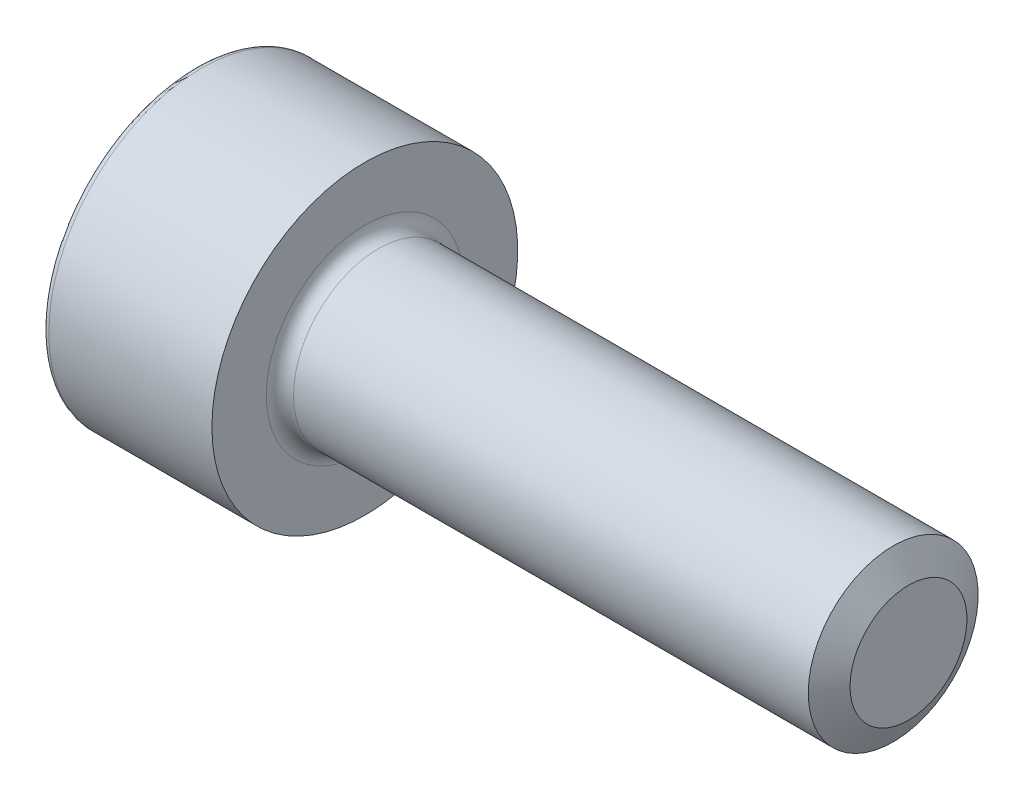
ISO-10303-21;
HEADER;
FILE_DESCRIPTION(('STEP AP214'),'2;1');
FILE_NAME('part.step','',(''),(''),'','','');
FILE_SCHEMA(('AUTOMOTIVE_DESIGN { 1 0 10303 214 1 1 1 1 }'));
ENDSEC;
DATA;
#1=APPLICATION_CONTEXT('core data for automotive mechanical design processes');
#2=APPLICATION_PROTOCOL_DEFINITION('international standard','automotive_design',2000,#1);
#3=PRODUCT_CONTEXT('',#1,'mechanical');
#4=PRODUCT('Part','Part','',(#3));
#5=PRODUCT_RELATED_PRODUCT_CATEGORY('part','',(#4));
#6=PRODUCT_DEFINITION_FORMATION('','',#4);
#7=PRODUCT_DEFINITION_CONTEXT('part definition',#1,'design');
#8=PRODUCT_DEFINITION('design','',#6,#7);
#9=PRODUCT_DEFINITION_SHAPE('','',#8);
#10=(LENGTH_UNIT() NAMED_UNIT(*) SI_UNIT(.MILLI.,.METRE.));
#11=(NAMED_UNIT(*) PLANE_ANGLE_UNIT() SI_UNIT($,.RADIAN.));
#12=(NAMED_UNIT(*) SI_UNIT($,.STERADIAN.) SOLID_ANGLE_UNIT());
#13=UNCERTAINTY_MEASURE_WITH_UNIT(LENGTH_MEASURE(1.E-05),#10,'distance_accuracy_value','');
#14=(GEOMETRIC_REPRESENTATION_CONTEXT(3) GLOBAL_UNCERTAINTY_ASSIGNED_CONTEXT((#13)) GLOBAL_UNIT_ASSIGNED_CONTEXT((#10,
#11,#12)) REPRESENTATION_CONTEXT('',''));
#15=CARTESIAN_POINT('',(0.,0.,0.));
#16=DIRECTION('',(0.,0.,1.));
#17=DIRECTION('',(1.,0.,0.));
#18=AXIS2_PLACEMENT_3D('',#15,#16,#17);
#19=CARTESIAN_POINT('',(10.5,1.25,0.));
#20=DIRECTION('',(-1.,0.,0.));
#21=DIRECTION('',(0.,0.,1.));
#22=AXIS2_PLACEMENT_3D('',#19,#20,#21);
#23=PLANE('',#22);
#24=CARTESIAN_POINT('',(10.5,0.,0.));
#25=DIRECTION('',(-1.,0.,0.));
#26=DIRECTION('',(0.,0.,1.));
#27=AXIS2_PLACEMENT_3D('',#24,#25,#26);
#28=CIRCLE('',#27,0.8603);
#29=CARTESIAN_POINT('',(10.5,0.,0.8603));
#30=VERTEX_POINT('',#29);
#31=EDGE_CURVE('E131',#30,#30,#28,.T.);
#32=ORIENTED_EDGE('',*,*,#31,.F.);
#33=EDGE_LOOP('',(#32));
#34=FACE_BOUND('',#33,.T.);
#35=ADVANCED_FACE('F17',(#34),#23,.F.);
#36=CARTESIAN_POINT('',(1.1,-0.995929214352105,0.575));
#37=DIRECTION('',(1.,0.,0.));
#38=DIRECTION('',(0.,1.,0.));
#39=AXIS2_PLACEMENT_3D('',#36,#37,#38);
#40=PLANE('',#39);
#41=DIRECTION('',(0.,0.866025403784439,0.5));
#42=VECTOR('',#41,1.);
#43=CARTESIAN_POINT('',(1.1,-0.995929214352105,0.575));
#44=LINE('',#43,#42);
#45=CARTESIAN_POINT('',(1.1,-0.995929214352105,0.575));
#46=VERTEX_POINT('',#45);
#47=CARTESIAN_POINT('',(1.1,0.,1.15));
#48=VERTEX_POINT('',#47);
#49=EDGE_CURVE('E118',#46,#48,#44,.T.);
#50=ORIENTED_EDGE('',*,*,#49,.T.);
#51=DIRECTION('',(0.,0.866025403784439,-0.5));
#52=VECTOR('',#51,1.);
#53=CARTESIAN_POINT('',(1.1,0.,1.15));
#54=LINE('',#53,#52);
#55=CARTESIAN_POINT('',(1.1,0.995929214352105,0.575));
#56=VERTEX_POINT('',#55);
#57=EDGE_CURVE('E11',#48,#56,#54,.T.);
#58=ORIENTED_EDGE('',*,*,#57,.T.);
#59=DIRECTION('',(0.,0.,-1.));
#60=VECTOR('',#59,1.);
#61=CARTESIAN_POINT('',(1.1,0.995929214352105,0.575));
#62=LINE('',#61,#60);
#63=CARTESIAN_POINT('',(1.1,0.995929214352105,-0.575));
#64=VERTEX_POINT('',#63);
#65=EDGE_CURVE('E44',#56,#64,#62,.T.);
#66=ORIENTED_EDGE('',*,*,#65,.T.);
#67=DIRECTION('',(0.,-0.866025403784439,-0.5));
#68=VECTOR('',#67,1.);
#69=CARTESIAN_POINT('',(1.1,0.995929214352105,-0.575));
#70=LINE('',#69,#68);
#71=CARTESIAN_POINT('',(1.1,0.,-1.15));
#72=VERTEX_POINT('',#71);
#73=EDGE_CURVE('E93',#64,#72,#70,.T.);
#74=ORIENTED_EDGE('',*,*,#73,.T.);
#75=DIRECTION('',(0.,-0.866025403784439,0.5));
#76=VECTOR('',#75,1.);
#77=CARTESIAN_POINT('',(1.1,0.,-1.15));
#78=LINE('',#77,#76);
#79=CARTESIAN_POINT('',(1.1,-0.995929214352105,-0.575));
#80=VERTEX_POINT('',#79);
#81=EDGE_CURVE('E86',#72,#80,#78,.T.);
#82=ORIENTED_EDGE('',*,*,#81,.T.);
#83=DIRECTION('',(0.,0.,1.));
#84=VECTOR('',#83,1.);
#85=CARTESIAN_POINT('',(1.1,-0.995929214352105,-0.575));
#86=LINE('',#85,#84);
#87=EDGE_CURVE('E90',#80,#46,#86,.T.);
#88=ORIENTED_EDGE('',*,*,#87,.T.);
#89=EDGE_LOOP('',(#50,#58,#66,#74,#82,#88));
#90=FACE_BOUND('',#89,.T.);
#91=ADVANCED_FACE('F88',(#90),#40,.F.);
#92=CARTESIAN_POINT('',(1.1,0.,1.15));
#93=DIRECTION('',(0.,0.5,0.866025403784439));
#94=DIRECTION('',(1.,0.,0.));
#95=AXIS2_PLACEMENT_3D('',#92,#93,#94);
#96=PLANE('',#95);
#97=DIRECTION('',(0.,0.866025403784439,-0.5));
#98=VECTOR('',#97,1.);
#99=CARTESIAN_POINT('',(0.,0.,1.15));
#100=LINE('',#99,#98);
#101=CARTESIAN_POINT('',(0.,0.,1.15));
#102=VERTEX_POINT('',#101);
#103=CARTESIAN_POINT('',(0.,0.995929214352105,0.575));
#104=VERTEX_POINT('',#103);
#105=EDGE_CURVE('E141',#102,#104,#100,.T.);
#106=ORIENTED_EDGE('',*,*,#105,.T.);
#107=DIRECTION('',(-1.,0.,0.));
#108=VECTOR('',#107,1.);
#109=CARTESIAN_POINT('',(1.1,0.995929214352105,0.575));
#110=LINE('',#109,#108);
#111=EDGE_CURVE('E25',#56,#104,#110,.T.);
#112=ORIENTED_EDGE('',*,*,#111,.F.);
#113=ORIENTED_EDGE('',*,*,#57,.F.);
#114=DIRECTION('',(-1.,0.,0.));
#115=VECTOR('',#114,1.);
#116=CARTESIAN_POINT('',(1.1,0.,1.15));
#117=LINE('',#116,#115);
#118=EDGE_CURVE('E137',#48,#102,#117,.T.);
#119=ORIENTED_EDGE('',*,*,#118,.T.);
#120=EDGE_LOOP('',(#106,#112,#113,#119));
#121=FACE_BOUND('',#120,.T.);
#122=ADVANCED_FACE('F196',(#121),#96,.F.);
#123=CARTESIAN_POINT('',(1.1,0.995929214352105,0.575));
#124=DIRECTION('',(0.,1.,0.));
#125=DIRECTION('',(0.,0.,-1.));
#126=AXIS2_PLACEMENT_3D('',#123,#124,#125);
#127=PLANE('',#126);
#128=DIRECTION('',(0.,0.,-1.));
#129=VECTOR('',#128,1.);
#130=CARTESIAN_POINT('',(0.,0.995929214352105,0.575));
#131=LINE('',#130,#129);
#132=CARTESIAN_POINT('',(0.,0.995929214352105,-0.575));
#133=VERTEX_POINT('',#132);
#134=EDGE_CURVE('E174',#104,#133,#131,.T.);
#135=ORIENTED_EDGE('',*,*,#134,.T.);
#136=DIRECTION('',(-1.,0.,0.));
#137=VECTOR('',#136,1.);
#138=CARTESIAN_POINT('',(1.1,0.995929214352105,-0.575));
#139=LINE('',#138,#137);
#140=EDGE_CURVE('E132',#64,#133,#139,.T.);
#141=ORIENTED_EDGE('',*,*,#140,.F.);
#142=ORIENTED_EDGE('',*,*,#65,.F.);
#143=ORIENTED_EDGE('',*,*,#111,.T.);
#144=EDGE_LOOP('',(#135,#141,#142,#143));
#145=FACE_BOUND('',#144,.T.);
#146=ADVANCED_FACE('F188',(#145),#127,.F.);
#147=CARTESIAN_POINT('',(1.1,0.995929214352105,-0.575));
#148=DIRECTION('',(0.,0.5,-0.866025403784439));
#149=DIRECTION('',(-1.,0.,0.));
#150=AXIS2_PLACEMENT_3D('',#147,#148,#149);
#151=PLANE('',#150);
#152=DIRECTION('',(0.,-0.866025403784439,-0.5));
#153=VECTOR('',#152,1.);
#154=CARTESIAN_POINT('',(0.,0.995929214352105,-0.575));
#155=LINE('',#154,#153);
#156=CARTESIAN_POINT('',(0.,0.,-1.15));
#157=VERTEX_POINT('',#156);
#158=EDGE_CURVE('E170',#133,#157,#155,.T.);
#159=ORIENTED_EDGE('',*,*,#158,.T.);
#160=DIRECTION('',(-1.,0.,0.));
#161=VECTOR('',#160,1.);
#162=CARTESIAN_POINT('',(1.1,0.,-1.15));
#163=LINE('',#162,#161);
#164=EDGE_CURVE('E97',#72,#157,#163,.T.);
#165=ORIENTED_EDGE('',*,*,#164,.F.);
#166=ORIENTED_EDGE('',*,*,#73,.F.);
#167=ORIENTED_EDGE('',*,*,#140,.T.);
#168=EDGE_LOOP('',(#159,#165,#166,#167));
#169=FACE_BOUND('',#168,.T.);
#170=ADVANCED_FACE('F246',(#169),#151,.F.);
#171=CARTESIAN_POINT('',(1.1,0.,-1.15));
#172=DIRECTION('',(0.,-0.5,-0.866025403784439));
#173=DIRECTION('',(0.,-0.866025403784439,0.5));
#174=AXIS2_PLACEMENT_3D('',#171,#172,#173);
#175=PLANE('',#174);
#176=DIRECTION('',(0.,-0.866025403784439,0.5));
#177=VECTOR('',#176,1.);
#178=CARTESIAN_POINT('',(0.,0.,-1.15));
#179=LINE('',#178,#177);
#180=CARTESIAN_POINT('',(0.,-0.995929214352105,-0.575));
#181=VERTEX_POINT('',#180);
#182=EDGE_CURVE('E103',#157,#181,#179,.T.);
#183=ORIENTED_EDGE('',*,*,#182,.T.);
#184=DIRECTION('',(-1.,0.,0.));
#185=VECTOR('',#184,1.);
#186=CARTESIAN_POINT('',(1.1,-0.995929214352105,-0.575));
#187=LINE('',#186,#185);
#188=EDGE_CURVE('E98',#80,#181,#187,.T.);
#189=ORIENTED_EDGE('',*,*,#188,.F.);
#190=ORIENTED_EDGE('',*,*,#81,.F.);
#191=ORIENTED_EDGE('',*,*,#164,.T.);
#192=EDGE_LOOP('',(#183,#189,#190,#191));
#193=FACE_BOUND('',#192,.T.);
#194=ADVANCED_FACE('F101',(#193),#175,.F.);
#195=CARTESIAN_POINT('',(1.1,-0.995929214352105,-0.575));
#196=DIRECTION('',(0.,-1.,0.));
#197=DIRECTION('',(0.,0.,-1.));
#198=AXIS2_PLACEMENT_3D('',#195,#196,#197);
#199=PLANE('',#198);
#200=DIRECTION('',(0.,0.,1.));
#201=VECTOR('',#200,1.);
#202=CARTESIAN_POINT('',(0.,-0.995929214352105,-0.575));
#203=LINE('',#202,#201);
#204=CARTESIAN_POINT('',(0.,-0.995929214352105,0.575));
#205=VERTEX_POINT('',#204);
#206=EDGE_CURVE('E165',#181,#205,#203,.T.);
#207=ORIENTED_EDGE('',*,*,#206,.T.);
#208=DIRECTION('',(-1.,0.,0.));
#209=VECTOR('',#208,1.);
#210=CARTESIAN_POINT('',(1.1,-0.995929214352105,0.575));
#211=LINE('',#210,#209);
#212=EDGE_CURVE('E110',#46,#205,#211,.T.);
#213=ORIENTED_EDGE('',*,*,#212,.F.);
#214=ORIENTED_EDGE('',*,*,#87,.F.);
#215=ORIENTED_EDGE('',*,*,#188,.T.);
#216=EDGE_LOOP('',(#207,#213,#214,#215));
#217=FACE_BOUND('',#216,.T.);
#218=ADVANCED_FACE('F109',(#217),#199,.F.);
#219=CARTESIAN_POINT('',(1.1,-0.995929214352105,0.575));
#220=DIRECTION('',(0.,-0.5,0.866025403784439));
#221=DIRECTION('',(-1.,0.,0.));
#222=AXIS2_PLACEMENT_3D('',#219,#220,#221);
#223=PLANE('',#222);
#224=DIRECTION('',(0.,0.866025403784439,0.5));
#225=VECTOR('',#224,1.);
#226=CARTESIAN_POINT('',(0.,-0.995929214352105,0.575));
#227=LINE('',#226,#225);
#228=EDGE_CURVE('E145',#205,#102,#227,.T.);
#229=ORIENTED_EDGE('',*,*,#228,.T.);
#230=ORIENTED_EDGE('',*,*,#118,.F.);
#231=ORIENTED_EDGE('',*,*,#49,.F.);
#232=ORIENTED_EDGE('',*,*,#212,.T.);
#233=EDGE_LOOP('',(#229,#230,#231,#232));
#234=FACE_BOUND('',#233,.T.);
#235=ADVANCED_FACE('F199',(#234),#223,.F.);
#236=CARTESIAN_POINT('',(2.5,2.25,0.));
#237=DIRECTION('',(-1.,0.,0.));
#238=DIRECTION('',(0.,0.,1.));
#239=AXIS2_PLACEMENT_3D('',#236,#237,#238);
#240=PLANE('',#239);
#241=CARTESIAN_POINT('',(2.5,0.,0.));
#242=DIRECTION('',(-1.,0.,0.));
#243=DIRECTION('',(0.,0.,1.));
#244=AXIS2_PLACEMENT_3D('',#241,#242,#243);
#245=CIRCLE('',#244,1.45);
#246=CARTESIAN_POINT('',(2.5,0.,1.45));
#247=VERTEX_POINT('',#246);
#248=EDGE_CURVE('E130',#247,#247,#245,.T.);
#249=ORIENTED_EDGE('',*,*,#248,.T.);
#250=EDGE_LOOP('',(#249));
#251=FACE_BOUND('',#250,.T.);
#252=CARTESIAN_POINT('',(2.5,0.,0.));
#253=DIRECTION('',(-1.,0.,0.));
#254=DIRECTION('',(0.,0.,1.));
#255=AXIS2_PLACEMENT_3D('',#252,#253,#254);
#256=CIRCLE('',#255,2.25);
#257=CARTESIAN_POINT('',(2.5,0.,2.25));
#258=VERTEX_POINT('',#257);
#259=EDGE_CURVE('E146',#258,#258,#256,.T.);
#260=ORIENTED_EDGE('',*,*,#259,.F.);
#261=EDGE_LOOP('',(#260));
#262=FACE_BOUND('',#261,.T.);
#263=ADVANCED_FACE('F201',(#251,#262),#240,.F.);
#264=CARTESIAN_POINT('',(0.,0.,0.));
#265=DIRECTION('',(1.,0.,0.));
#266=DIRECTION('',(0.,1.,0.));
#267=AXIS2_PLACEMENT_3D('',#264,#265,#266);
#268=PLANE('',#267);
#269=ORIENTED_EDGE('',*,*,#105,.F.);
#270=ORIENTED_EDGE('',*,*,#228,.F.);
#271=ORIENTED_EDGE('',*,*,#206,.F.);
#272=ORIENTED_EDGE('',*,*,#182,.F.);
#273=ORIENTED_EDGE('',*,*,#158,.F.);
#274=ORIENTED_EDGE('',*,*,#134,.F.);
#275=EDGE_LOOP('',(#269,#270,#271,#272,#273,#274));
#276=FACE_BOUND('',#275,.T.);
#277=CARTESIAN_POINT('',(0.,0.,0.));
#278=DIRECTION('',(-1.,0.,0.));
#279=DIRECTION('',(0.,0.,-1.));
#280=AXIS2_PLACEMENT_3D('',#277,#278,#279);
#281=CIRCLE('',#280,2.15);
#282=CARTESIAN_POINT('',(0.,0.,-2.15));
#283=VERTEX_POINT('',#282);
#284=EDGE_CURVE('E121',#283,#283,#281,.T.);
#285=ORIENTED_EDGE('',*,*,#284,.T.);
#286=EDGE_LOOP('',(#285));
#287=FACE_BOUND('',#286,.T.);
#288=ADVANCED_FACE('F193',(#276,#287),#268,.F.);
#289=CARTESIAN_POINT('',(0.,0.,0.));
#290=DIRECTION('',(-1.,0.,0.));
#291=DIRECTION('',(0.,0.,1.));
#292=AXIS2_PLACEMENT_3D('',#289,#290,#291);
#293=CYLINDRICAL_SURFACE('',#292,1.25);
#294=CARTESIAN_POINT('',(2.7,0.,0.));
#295=DIRECTION('',(-1.,0.,0.));
#296=DIRECTION('',(0.,0.,1.));
#297=AXIS2_PLACEMENT_3D('',#294,#295,#296);
#298=CIRCLE('',#297,1.25);
#299=CARTESIAN_POINT('',(2.7,0.,1.25));
#300=VERTEX_POINT('',#299);
#301=EDGE_CURVE('E155',#300,#300,#298,.T.);
#302=ORIENTED_EDGE('',*,*,#301,.F.);
#303=EDGE_LOOP('',(#302));
#304=FACE_BOUND('',#303,.T.);
#305=CARTESIAN_POINT('',(10.2750066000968,0.,0.));
#306=DIRECTION('',(-1.,0.,0.));
#307=DIRECTION('',(0.,0.,1.));
#308=AXIS2_PLACEMENT_3D('',#305,#306,#307);
#309=CIRCLE('',#308,1.25);
#310=CARTESIAN_POINT('',(10.2750066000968,0.,1.25));
#311=VERTEX_POINT('',#310);
#312=EDGE_CURVE('E126',#311,#311,#309,.T.);
#313=ORIENTED_EDGE('',*,*,#312,.T.);
#314=EDGE_LOOP('',(#313));
#315=FACE_BOUND('',#314,.T.);
#316=ADVANCED_FACE('F238',(#304,#315),#293,.T.);
#317=CARTESIAN_POINT('',(0.,0.,0.));
#318=DIRECTION('',(-1.,0.,0.));
#319=DIRECTION('',(0.,0.,1.));
#320=AXIS2_PLACEMENT_3D('',#317,#318,#319);
#321=CYLINDRICAL_SURFACE('',#320,2.25);
#322=CARTESIAN_POINT('',(0.1,0.,0.));
#323=DIRECTION('',(1.,0.,0.));
#324=DIRECTION('',(0.,0.,-1.));
#325=AXIS2_PLACEMENT_3D('',#322,#323,#324);
#326=CIRCLE('',#325,2.25);
#327=CARTESIAN_POINT('',(0.1,0.,-2.25));
#328=VERTEX_POINT('',#327);
#329=EDGE_CURVE('E125',#328,#328,#326,.T.);
#330=ORIENTED_EDGE('',*,*,#329,.T.);
#331=EDGE_LOOP('',(#330));
#332=FACE_BOUND('',#331,.T.);
#333=ORIENTED_EDGE('',*,*,#259,.T.);
#334=EDGE_LOOP('',(#333));
#335=FACE_BOUND('',#334,.T.);
#336=ADVANCED_FACE('F231',(#332,#335),#321,.T.);
#337=CARTESIAN_POINT('',(2.7,0.,0.));
#338=DIRECTION('',(-1.,0.,0.));
#339=DIRECTION('',(0.,0.,1.));
#340=AXIS2_PLACEMENT_3D('',#337,#338,#339);
#341=TOROIDAL_SURFACE('',#340,1.45,0.2);
#342=ORIENTED_EDGE('',*,*,#301,.T.);
#343=EDGE_LOOP('',(#342));
#344=FACE_BOUND('',#343,.T.);
#345=ORIENTED_EDGE('',*,*,#248,.F.);
#346=EDGE_LOOP('',(#345));
#347=FACE_BOUND('',#346,.T.);
#348=ADVANCED_FACE('F222',(#344,#347),#341,.F.);
#349=CARTESIAN_POINT('',(10.2750066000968,0.,0.));
#350=DIRECTION('',(-1.,0.,0.));
#351=DIRECTION('',(0.,0.,1.));
#352=AXIS2_PLACEMENT_3D('',#349,#350,#351);
#353=CONICAL_SURFACE('',#352,1.25,1.04719755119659);
#354=ORIENTED_EDGE('',*,*,#312,.F.);
#355=EDGE_LOOP('',(#354));
#356=FACE_BOUND('',#355,.T.);
#357=ORIENTED_EDGE('',*,*,#31,.T.);
#358=EDGE_LOOP('',(#357));
#359=FACE_BOUND('',#358,.T.);
#360=ADVANCED_FACE('F219',(#356,#359),#353,.T.);
#361=CARTESIAN_POINT('',(0.1,0.,0.));
#362=DIRECTION('',(1.,0.,0.));
#363=DIRECTION('',(0.,0.,-1.));
#364=AXIS2_PLACEMENT_3D('',#361,#362,#363);
#365=TOROIDAL_SURFACE('',#364,2.15,0.1);
#366=ORIENTED_EDGE('',*,*,#329,.F.);
#367=EDGE_LOOP('',(#366));
#368=FACE_BOUND('',#367,.T.);
#369=ORIENTED_EDGE('',*,*,#284,.F.);
#370=EDGE_LOOP('',(#369));
#371=FACE_BOUND('',#370,.T.);
#372=ADVANCED_FACE('F221',(#368,#371),#365,.T.);
#373=CLOSED_SHELL('',(#35,#91,#122,#146,#170,#194,#218,#235,#263,#288,#316,#336,#348,#360,#372));
#374=MANIFOLD_SOLID_BREP('B1',#373);
#375=ADVANCED_BREP_SHAPE_REPRESENTATION('',(#18,#374),#14);
#376=SHAPE_DEFINITION_REPRESENTATION(#9,#375);
ENDSEC;
END-ISO-10303-21;
